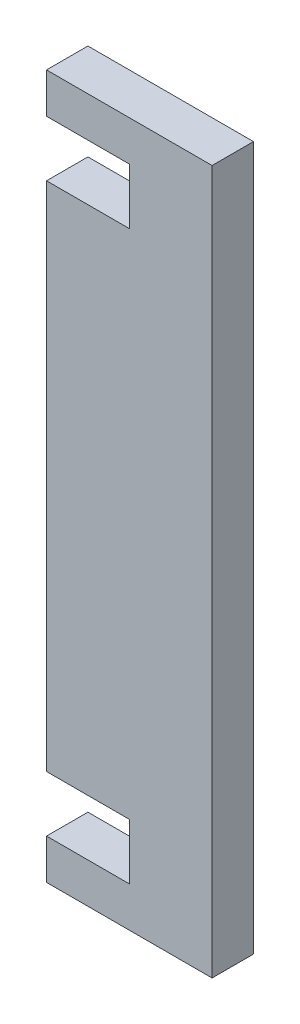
ISO-10303-21;
HEADER;
FILE_DESCRIPTION(('STEP AP214'),'2;1');
FILE_NAME('part.step','',(''),(''),'','','');
FILE_SCHEMA(('AUTOMOTIVE_DESIGN { 1 0 10303 214 1 1 1 1 }'));
ENDSEC;
DATA;
#1=APPLICATION_CONTEXT('core data for automotive mechanical design processes');
#2=APPLICATION_PROTOCOL_DEFINITION('international standard','automotive_design',2000,#1);
#3=PRODUCT_CONTEXT('',#1,'mechanical');
#4=PRODUCT('Part','Part','',(#3));
#5=PRODUCT_RELATED_PRODUCT_CATEGORY('part','',(#4));
#6=PRODUCT_DEFINITION_FORMATION('','',#4);
#7=PRODUCT_DEFINITION_CONTEXT('part definition',#1,'design');
#8=PRODUCT_DEFINITION('design','',#6,#7);
#9=PRODUCT_DEFINITION_SHAPE('','',#8);
#10=(LENGTH_UNIT() NAMED_UNIT(*) SI_UNIT(.MILLI.,.METRE.));
#11=(NAMED_UNIT(*) PLANE_ANGLE_UNIT() SI_UNIT($,.RADIAN.));
#12=(NAMED_UNIT(*) SI_UNIT($,.STERADIAN.) SOLID_ANGLE_UNIT());
#13=UNCERTAINTY_MEASURE_WITH_UNIT(LENGTH_MEASURE(1.E-05),#10,'distance_accuracy_value','');
#14=(GEOMETRIC_REPRESENTATION_CONTEXT(3) GLOBAL_UNCERTAINTY_ASSIGNED_CONTEXT((#13)) GLOBAL_UNIT_ASSIGNED_CONTEXT((#10,
#11,#12)) REPRESENTATION_CONTEXT('',''));
#15=CARTESIAN_POINT('',(0.,0.,0.));
#16=DIRECTION('',(0.,0.,1.));
#17=DIRECTION('',(1.,0.,0.));
#18=AXIS2_PLACEMENT_3D('',#15,#16,#17);
#19=CARTESIAN_POINT('',(0.,0.,10.));
#20=DIRECTION('',(1.,0.,0.));
#21=DIRECTION('',(0.,1.,0.));
#22=AXIS2_PLACEMENT_3D('',#19,#20,#21);
#23=PLANE('',#22);
#24=DIRECTION('',(0.,-1.,0.));
#25=VECTOR('',#24,1.);
#26=CARTESIAN_POINT('',(0.,0.,0.));
#27=LINE('',#26,#25);
#28=CARTESIAN_POINT('',(0.,170.,0.));
#29=VERTEX_POINT('',#28);
#30=CARTESIAN_POINT('',(0.,160.3,0.));
#31=VERTEX_POINT('',#30);
#32=EDGE_CURVE('E146',#29,#31,#27,.T.);
#33=ORIENTED_EDGE('',*,*,#32,.T.);
#34=DIRECTION('',(0.,0.,1.));
#35=VECTOR('',#34,1.);
#36=CARTESIAN_POINT('',(0.,160.3,0.));
#37=LINE('',#36,#35);
#38=CARTESIAN_POINT('',(0.,160.3,10.));
#39=VERTEX_POINT('',#38);
#40=EDGE_CURVE('E151',#31,#39,#37,.T.);
#41=ORIENTED_EDGE('',*,*,#40,.T.);
#42=DIRECTION('',(0.,-1.,0.));
#43=VECTOR('',#42,1.);
#44=CARTESIAN_POINT('',(0.,0.,10.));
#45=LINE('',#44,#43);
#46=CARTESIAN_POINT('',(0.,170.,10.));
#47=VERTEX_POINT('',#46);
#48=EDGE_CURVE('E189',#47,#39,#45,.T.);
#49=ORIENTED_EDGE('',*,*,#48,.F.);
#50=DIRECTION('',(0.,0.,-1.));
#51=VECTOR('',#50,1.);
#52=CARTESIAN_POINT('',(0.,170.,10.));
#53=LINE('',#52,#51);
#54=EDGE_CURVE('E162',#47,#29,#53,.T.);
#55=ORIENTED_EDGE('',*,*,#54,.T.);
#56=EDGE_LOOP('',(#33,#41,#49,#55));
#57=FACE_BOUND('',#56,.T.);
#58=ADVANCED_FACE('F35',(#57),#23,.F.);
#59=CARTESIAN_POINT('',(0.,9.70000000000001,10.));
#60=VERTEX_POINT('',#59);
#61=CARTESIAN_POINT('',(0.,0.,10.));
#62=VERTEX_POINT('',#61);
#63=EDGE_CURVE('E161',#60,#62,#45,.T.);
#64=ORIENTED_EDGE('',*,*,#63,.F.);
#65=DIRECTION('',(0.,0.,1.));
#66=VECTOR('',#65,1.);
#67=CARTESIAN_POINT('',(0.,9.70000000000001,0.));
#68=LINE('',#67,#66);
#69=CARTESIAN_POINT('',(0.,9.70000000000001,0.));
#70=VERTEX_POINT('',#69);
#71=EDGE_CURVE('E207',#70,#60,#68,.T.);
#72=ORIENTED_EDGE('',*,*,#71,.F.);
#73=CARTESIAN_POINT('',(0.,0.,0.));
#74=VERTEX_POINT('',#73);
#75=EDGE_CURVE('E147',#70,#74,#27,.T.);
#76=ORIENTED_EDGE('',*,*,#75,.T.);
#77=DIRECTION('',(0.,0.,-1.));
#78=VECTOR('',#77,1.);
#79=CARTESIAN_POINT('',(0.,0.,10.));
#80=LINE('',#79,#78);
#81=EDGE_CURVE('E11',#62,#74,#80,.T.);
#82=ORIENTED_EDGE('',*,*,#81,.F.);
#83=EDGE_LOOP('',(#64,#72,#76,#82));
#84=FACE_BOUND('',#83,.T.);
#85=ADVANCED_FACE('F206',(#84),#23,.F.);
#86=CARTESIAN_POINT('',(0.,146.8,10.));
#87=VERTEX_POINT('',#86);
#88=CARTESIAN_POINT('',(0.,23.2,10.));
#89=VERTEX_POINT('',#88);
#90=EDGE_CURVE('E140',#87,#89,#45,.T.);
#91=ORIENTED_EDGE('',*,*,#90,.F.);
#92=DIRECTION('',(0.,0.,1.));
#93=VECTOR('',#92,1.);
#94=CARTESIAN_POINT('',(0.,146.8,0.));
#95=LINE('',#94,#93);
#96=CARTESIAN_POINT('',(0.,146.8,0.));
#97=VERTEX_POINT('',#96);
#98=EDGE_CURVE('E127',#97,#87,#95,.T.);
#99=ORIENTED_EDGE('',*,*,#98,.F.);
#100=CARTESIAN_POINT('',(0.,23.2,0.));
#101=VERTEX_POINT('',#100);
#102=EDGE_CURVE('E138',#97,#101,#27,.T.);
#103=ORIENTED_EDGE('',*,*,#102,.T.);
#104=DIRECTION('',(0.,0.,1.));
#105=VECTOR('',#104,1.);
#106=CARTESIAN_POINT('',(0.,23.2,0.));
#107=LINE('',#106,#105);
#108=EDGE_CURVE('E227',#101,#89,#107,.T.);
#109=ORIENTED_EDGE('',*,*,#108,.T.);
#110=EDGE_LOOP('',(#91,#99,#103,#109));
#111=FACE_BOUND('',#110,.T.);
#112=ADVANCED_FACE('F37',(#111),#23,.F.);
#113=CARTESIAN_POINT('',(0.,0.,10.));
#114=DIRECTION('',(0.,1.,0.));
#115=DIRECTION('',(0.,0.,1.));
#116=AXIS2_PLACEMENT_3D('',#113,#114,#115);
#117=PLANE('',#116);
#118=DIRECTION('',(1.,0.,0.));
#119=VECTOR('',#118,1.);
#120=CARTESIAN_POINT('',(0.,0.,0.));
#121=LINE('',#120,#119);
#122=CARTESIAN_POINT('',(40.,0.,0.));
#123=VERTEX_POINT('',#122);
#124=EDGE_CURVE('E150',#74,#123,#121,.T.);
#125=ORIENTED_EDGE('',*,*,#124,.T.);
#126=DIRECTION('',(0.,0.,-1.));
#127=VECTOR('',#126,1.);
#128=CARTESIAN_POINT('',(40.,0.,10.));
#129=LINE('',#128,#127);
#130=CARTESIAN_POINT('',(40.,0.,10.));
#131=VERTEX_POINT('',#130);
#132=EDGE_CURVE('E43',#131,#123,#129,.T.);
#133=ORIENTED_EDGE('',*,*,#132,.F.);
#134=DIRECTION('',(1.,0.,0.));
#135=VECTOR('',#134,1.);
#136=CARTESIAN_POINT('',(0.,0.,10.));
#137=LINE('',#136,#135);
#138=EDGE_CURVE('E192',#62,#131,#137,.T.);
#139=ORIENTED_EDGE('',*,*,#138,.F.);
#140=ORIENTED_EDGE('',*,*,#81,.T.);
#141=EDGE_LOOP('',(#125,#133,#139,#140));
#142=FACE_BOUND('',#141,.T.);
#143=ADVANCED_FACE('F205',(#142),#117,.F.);
#144=CARTESIAN_POINT('',(40.,0.,10.));
#145=DIRECTION('',(-1.,0.,0.));
#146=DIRECTION('',(0.,-1.,0.));
#147=AXIS2_PLACEMENT_3D('',#144,#145,#146);
#148=PLANE('',#147);
#149=DIRECTION('',(0.,1.,0.));
#150=VECTOR('',#149,1.);
#151=CARTESIAN_POINT('',(40.,0.,0.));
#152=LINE('',#151,#150);
#153=CARTESIAN_POINT('',(40.,170.,0.));
#154=VERTEX_POINT('',#153);
#155=EDGE_CURVE('E157',#123,#154,#152,.T.);
#156=ORIENTED_EDGE('',*,*,#155,.T.);
#157=DIRECTION('',(0.,0.,-1.));
#158=VECTOR('',#157,1.);
#159=CARTESIAN_POINT('',(40.,170.,10.));
#160=LINE('',#159,#158);
#161=CARTESIAN_POINT('',(40.,170.,10.));
#162=VERTEX_POINT('',#161);
#163=EDGE_CURVE('E165',#162,#154,#160,.T.);
#164=ORIENTED_EDGE('',*,*,#163,.F.);
#165=DIRECTION('',(0.,1.,0.));
#166=VECTOR('',#165,1.);
#167=CARTESIAN_POINT('',(40.,0.,10.));
#168=LINE('',#167,#166);
#169=EDGE_CURVE('E174',#131,#162,#168,.T.);
#170=ORIENTED_EDGE('',*,*,#169,.F.);
#171=ORIENTED_EDGE('',*,*,#132,.T.);
#172=EDGE_LOOP('',(#156,#164,#170,#171));
#173=FACE_BOUND('',#172,.T.);
#174=ADVANCED_FACE('F172',(#173),#148,.F.);
#175=CARTESIAN_POINT('',(0.,170.,10.));
#176=DIRECTION('',(0.,-1.,0.));
#177=DIRECTION('',(0.,0.,-1.));
#178=AXIS2_PLACEMENT_3D('',#175,#176,#177);
#179=PLANE('',#178);
#180=DIRECTION('',(-1.,0.,0.));
#181=VECTOR('',#180,1.);
#182=CARTESIAN_POINT('',(0.,170.,0.));
#183=LINE('',#182,#181);
#184=EDGE_CURVE('E159',#154,#29,#183,.T.);
#185=ORIENTED_EDGE('',*,*,#184,.T.);
#186=ORIENTED_EDGE('',*,*,#54,.F.);
#187=DIRECTION('',(-1.,0.,0.));
#188=VECTOR('',#187,1.);
#189=CARTESIAN_POINT('',(0.,170.,10.));
#190=LINE('',#189,#188);
#191=EDGE_CURVE('E154',#162,#47,#190,.T.);
#192=ORIENTED_EDGE('',*,*,#191,.F.);
#193=ORIENTED_EDGE('',*,*,#163,.T.);
#194=EDGE_LOOP('',(#185,#186,#192,#193));
#195=FACE_BOUND('',#194,.T.);
#196=ADVANCED_FACE('F183',(#195),#179,.F.);
#197=CARTESIAN_POINT('',(0.,0.,10.));
#198=DIRECTION('',(0.,0.,-1.));
#199=DIRECTION('',(-1.,0.,0.));
#200=AXIS2_PLACEMENT_3D('',#197,#198,#199);
#201=PLANE('',#200);
#202=ORIENTED_EDGE('',*,*,#48,.T.);
#203=DIRECTION('',(-1.,0.,0.));
#204=VECTOR('',#203,1.);
#205=CARTESIAN_POINT('',(0.,160.3,10.));
#206=LINE('',#205,#204);
#207=CARTESIAN_POINT('',(20.,160.3,10.));
#208=VERTEX_POINT('',#207);
#209=EDGE_CURVE('E132',#208,#39,#206,.T.);
#210=ORIENTED_EDGE('',*,*,#209,.F.);
#211=DIRECTION('',(0.,1.,0.));
#212=VECTOR('',#211,1.);
#213=CARTESIAN_POINT('',(20.,160.3,10.));
#214=LINE('',#213,#212);
#215=CARTESIAN_POINT('',(20.,146.8,10.));
#216=VERTEX_POINT('',#215);
#217=EDGE_CURVE('E317',#216,#208,#214,.T.);
#218=ORIENTED_EDGE('',*,*,#217,.F.);
#219=DIRECTION('',(1.,0.,0.));
#220=VECTOR('',#219,1.);
#221=CARTESIAN_POINT('',(0.,146.8,10.));
#222=LINE('',#221,#220);
#223=EDGE_CURVE('E226',#87,#216,#222,.T.);
#224=ORIENTED_EDGE('',*,*,#223,.F.);
#225=ORIENTED_EDGE('',*,*,#90,.T.);
#226=DIRECTION('',(-1.,0.,0.));
#227=VECTOR('',#226,1.);
#228=CARTESIAN_POINT('',(0.,23.2,10.));
#229=LINE('',#228,#227);
#230=CARTESIAN_POINT('',(20.,23.2,10.));
#231=VERTEX_POINT('',#230);
#232=EDGE_CURVE('E213',#231,#89,#229,.T.);
#233=ORIENTED_EDGE('',*,*,#232,.F.);
#234=DIRECTION('',(0.,1.,0.));
#235=VECTOR('',#234,1.);
#236=CARTESIAN_POINT('',(20.,9.70000000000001,10.));
#237=LINE('',#236,#235);
#238=CARTESIAN_POINT('',(20.,9.70000000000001,10.));
#239=VERTEX_POINT('',#238);
#240=EDGE_CURVE('E216',#239,#231,#237,.T.);
#241=ORIENTED_EDGE('',*,*,#240,.F.);
#242=DIRECTION('',(1.,0.,0.));
#243=VECTOR('',#242,1.);
#244=CARTESIAN_POINT('',(0.,9.70000000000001,10.));
#245=LINE('',#244,#243);
#246=EDGE_CURVE('E201',#60,#239,#245,.T.);
#247=ORIENTED_EDGE('',*,*,#246,.F.);
#248=ORIENTED_EDGE('',*,*,#63,.T.);
#249=ORIENTED_EDGE('',*,*,#138,.T.);
#250=ORIENTED_EDGE('',*,*,#169,.T.);
#251=ORIENTED_EDGE('',*,*,#191,.T.);
#252=EDGE_LOOP('',(#202,#210,#218,#224,#225,#233,#241,#247,#248,#249,#250,#251));
#253=FACE_BOUND('',#252,.T.);
#254=ADVANCED_FACE('F198',(#253),#201,.F.);
#255=CARTESIAN_POINT('',(0.,0.,0.));
#256=DIRECTION('',(0.,0.,-1.));
#257=DIRECTION('',(-1.,0.,0.));
#258=AXIS2_PLACEMENT_3D('',#255,#256,#257);
#259=PLANE('',#258);
#260=DIRECTION('',(-1.,0.,0.));
#261=VECTOR('',#260,1.);
#262=CARTESIAN_POINT('',(0.,160.3,0.));
#263=LINE('',#262,#261);
#264=CARTESIAN_POINT('',(20.,160.3,0.));
#265=VERTEX_POINT('',#264);
#266=EDGE_CURVE('E141',#265,#31,#263,.T.);
#267=ORIENTED_EDGE('',*,*,#266,.T.);
#268=ORIENTED_EDGE('',*,*,#32,.F.);
#269=ORIENTED_EDGE('',*,*,#184,.F.);
#270=ORIENTED_EDGE('',*,*,#155,.F.);
#271=ORIENTED_EDGE('',*,*,#124,.F.);
#272=ORIENTED_EDGE('',*,*,#75,.F.);
#273=DIRECTION('',(1.,0.,0.));
#274=VECTOR('',#273,1.);
#275=CARTESIAN_POINT('',(0.,9.70000000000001,0.));
#276=LINE('',#275,#274);
#277=CARTESIAN_POINT('',(20.,9.70000000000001,0.));
#278=VERTEX_POINT('',#277);
#279=EDGE_CURVE('E209',#70,#278,#276,.T.);
#280=ORIENTED_EDGE('',*,*,#279,.T.);
#281=DIRECTION('',(0.,1.,0.));
#282=VECTOR('',#281,1.);
#283=CARTESIAN_POINT('',(20.,9.70000000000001,0.));
#284=LINE('',#283,#282);
#285=CARTESIAN_POINT('',(20.,23.2,0.));
#286=VERTEX_POINT('',#285);
#287=EDGE_CURVE('E211',#278,#286,#284,.T.);
#288=ORIENTED_EDGE('',*,*,#287,.T.);
#289=DIRECTION('',(-1.,0.,0.));
#290=VECTOR('',#289,1.);
#291=CARTESIAN_POINT('',(0.,23.2,0.));
#292=LINE('',#291,#290);
#293=EDGE_CURVE('E58',#286,#101,#292,.T.);
#294=ORIENTED_EDGE('',*,*,#293,.T.);
#295=ORIENTED_EDGE('',*,*,#102,.F.);
#296=DIRECTION('',(1.,0.,0.));
#297=VECTOR('',#296,1.);
#298=CARTESIAN_POINT('',(0.,146.8,0.));
#299=LINE('',#298,#297);
#300=CARTESIAN_POINT('',(20.,146.8,0.));
#301=VERTEX_POINT('',#300);
#302=EDGE_CURVE('E123',#97,#301,#299,.T.);
#303=ORIENTED_EDGE('',*,*,#302,.T.);
#304=DIRECTION('',(0.,1.,0.));
#305=VECTOR('',#304,1.);
#306=CARTESIAN_POINT('',(20.,160.3,0.));
#307=LINE('',#306,#305);
#308=EDGE_CURVE('E50',#301,#265,#307,.T.);
#309=ORIENTED_EDGE('',*,*,#308,.T.);
#310=EDGE_LOOP('',(#267,#268,#269,#270,#271,#272,#280,#288,#294,#295,#303,#309));
#311=FACE_BOUND('',#310,.T.);
#312=ADVANCED_FACE('F144',(#311),#259,.T.);
#313=CARTESIAN_POINT('',(0.,9.70000000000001,0.));
#314=DIRECTION('',(0.,-1.,0.));
#315=DIRECTION('',(0.,0.,-1.));
#316=AXIS2_PLACEMENT_3D('',#313,#314,#315);
#317=PLANE('',#316);
#318=ORIENTED_EDGE('',*,*,#246,.T.);
#319=DIRECTION('',(0.,0.,1.));
#320=VECTOR('',#319,1.);
#321=CARTESIAN_POINT('',(20.,9.70000000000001,0.));
#322=LINE('',#321,#320);
#323=EDGE_CURVE('E221',#278,#239,#322,.T.);
#324=ORIENTED_EDGE('',*,*,#323,.F.);
#325=ORIENTED_EDGE('',*,*,#279,.F.);
#326=ORIENTED_EDGE('',*,*,#71,.T.);
#327=EDGE_LOOP('',(#318,#324,#325,#326));
#328=FACE_BOUND('',#327,.T.);
#329=ADVANCED_FACE('F233',(#328),#317,.F.);
#330=CARTESIAN_POINT('',(0.,23.2,0.));
#331=DIRECTION('',(0.,1.,0.));
#332=DIRECTION('',(0.,0.,1.));
#333=AXIS2_PLACEMENT_3D('',#330,#331,#332);
#334=PLANE('',#333);
#335=ORIENTED_EDGE('',*,*,#232,.T.);
#336=ORIENTED_EDGE('',*,*,#108,.F.);
#337=ORIENTED_EDGE('',*,*,#293,.F.);
#338=DIRECTION('',(0.,0.,1.));
#339=VECTOR('',#338,1.);
#340=CARTESIAN_POINT('',(20.,23.2,0.));
#341=LINE('',#340,#339);
#342=EDGE_CURVE('E229',#286,#231,#341,.T.);
#343=ORIENTED_EDGE('',*,*,#342,.T.);
#344=EDGE_LOOP('',(#335,#336,#337,#343));
#345=FACE_BOUND('',#344,.T.);
#346=ADVANCED_FACE('F234',(#345),#334,.F.);
#347=CARTESIAN_POINT('',(20.,9.70000000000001,0.));
#348=DIRECTION('',(1.,0.,0.));
#349=DIRECTION('',(0.,0.,-1.));
#350=AXIS2_PLACEMENT_3D('',#347,#348,#349);
#351=PLANE('',#350);
#352=ORIENTED_EDGE('',*,*,#240,.T.);
#353=ORIENTED_EDGE('',*,*,#342,.F.);
#354=ORIENTED_EDGE('',*,*,#287,.F.);
#355=ORIENTED_EDGE('',*,*,#323,.T.);
#356=EDGE_LOOP('',(#352,#353,#354,#355));
#357=FACE_BOUND('',#356,.T.);
#358=ADVANCED_FACE('F231',(#357),#351,.F.);
#359=CARTESIAN_POINT('',(0.,160.3,0.));
#360=DIRECTION('',(0.,1.,0.));
#361=DIRECTION('',(0.,0.,1.));
#362=AXIS2_PLACEMENT_3D('',#359,#360,#361);
#363=PLANE('',#362);
#364=ORIENTED_EDGE('',*,*,#209,.T.);
#365=ORIENTED_EDGE('',*,*,#40,.F.);
#366=ORIENTED_EDGE('',*,*,#266,.F.);
#367=DIRECTION('',(0.,0.,1.));
#368=VECTOR('',#367,1.);
#369=CARTESIAN_POINT('',(20.,160.3,0.));
#370=LINE('',#369,#368);
#371=EDGE_CURVE('E318',#265,#208,#370,.T.);
#372=ORIENTED_EDGE('',*,*,#371,.T.);
#373=EDGE_LOOP('',(#364,#365,#366,#372));
#374=FACE_BOUND('',#373,.T.);
#375=ADVANCED_FACE('F241',(#374),#363,.F.);
#376=CARTESIAN_POINT('',(20.,160.3,0.));
#377=DIRECTION('',(1.,0.,0.));
#378=DIRECTION('',(0.,0.,-1.));
#379=AXIS2_PLACEMENT_3D('',#376,#377,#378);
#380=PLANE('',#379);
#381=ORIENTED_EDGE('',*,*,#217,.T.);
#382=ORIENTED_EDGE('',*,*,#371,.F.);
#383=ORIENTED_EDGE('',*,*,#308,.F.);
#384=DIRECTION('',(0.,0.,1.));
#385=VECTOR('',#384,1.);
#386=CARTESIAN_POINT('',(20.,146.8,0.));
#387=LINE('',#386,#385);
#388=EDGE_CURVE('E129',#301,#216,#387,.T.);
#389=ORIENTED_EDGE('',*,*,#388,.T.);
#390=EDGE_LOOP('',(#381,#382,#383,#389));
#391=FACE_BOUND('',#390,.T.);
#392=ADVANCED_FACE('F295',(#391),#380,.F.);
#393=CARTESIAN_POINT('',(0.,146.8,0.));
#394=DIRECTION('',(0.,-1.,0.));
#395=DIRECTION('',(0.,0.,-1.));
#396=AXIS2_PLACEMENT_3D('',#393,#394,#395);
#397=PLANE('',#396);
#398=ORIENTED_EDGE('',*,*,#223,.T.);
#399=ORIENTED_EDGE('',*,*,#388,.F.);
#400=ORIENTED_EDGE('',*,*,#302,.F.);
#401=ORIENTED_EDGE('',*,*,#98,.T.);
#402=EDGE_LOOP('',(#398,#399,#400,#401));
#403=FACE_BOUND('',#402,.T.);
#404=ADVANCED_FACE('F126',(#403),#397,.F.);
#405=CLOSED_SHELL('',(#58,#85,#112,#143,#174,#196,#254,#312,#329,#346,#358,#375,#392,#404));
#406=MANIFOLD_SOLID_BREP('B2',#405);
#407=ADVANCED_BREP_SHAPE_REPRESENTATION('',(#18,#406),#14);
#408=SHAPE_DEFINITION_REPRESENTATION(#9,#407);
ENDSEC;
END-ISO-10303-21;
